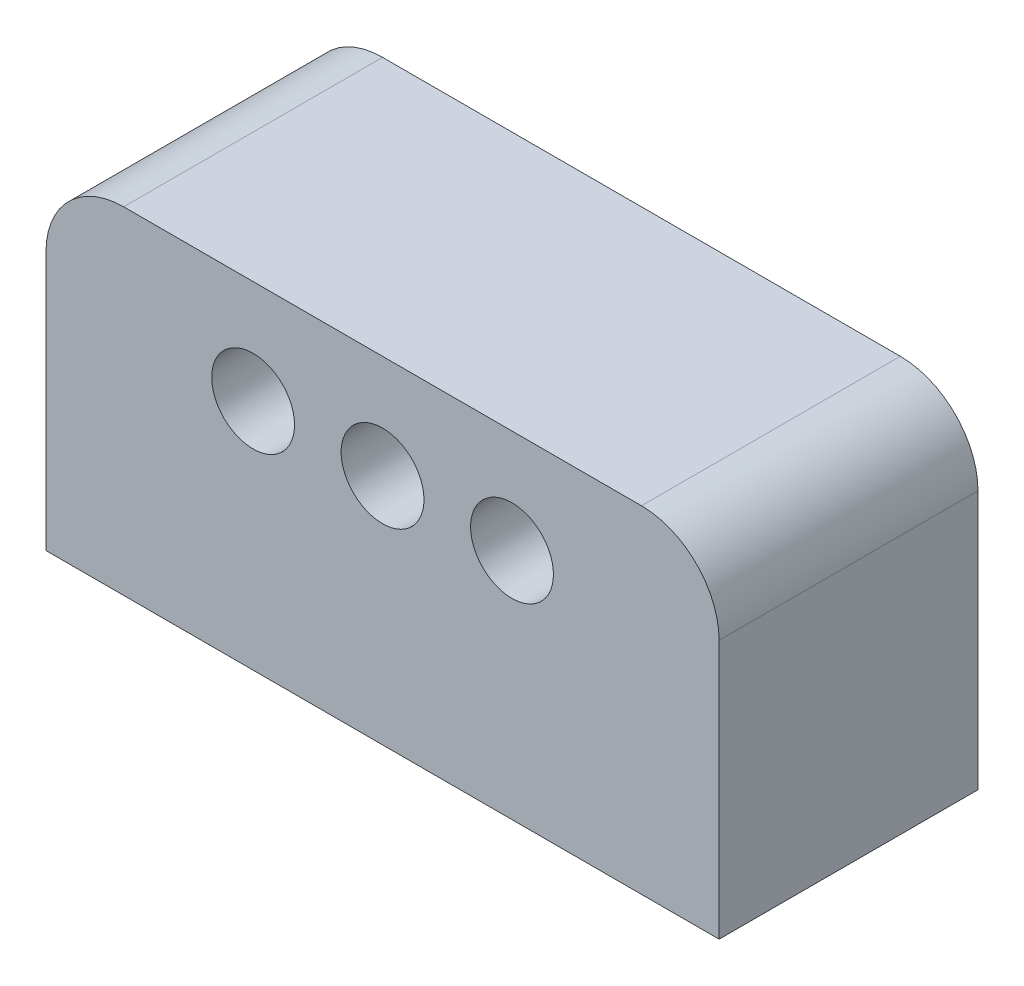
ISO-10303-21;
HEADER;
FILE_DESCRIPTION(('STEP AP214'),'2;1');
FILE_NAME('part.step','',(''),(''),'','','');
FILE_SCHEMA(('AUTOMOTIVE_DESIGN { 1 0 10303 214 1 1 1 1 }'));
ENDSEC;
DATA;
#1=APPLICATION_CONTEXT('core data for automotive mechanical design processes');
#2=APPLICATION_PROTOCOL_DEFINITION('international standard','automotive_design',2000,#1);
#3=PRODUCT_CONTEXT('',#1,'mechanical');
#4=PRODUCT('Part','Part','',(#3));
#5=PRODUCT_RELATED_PRODUCT_CATEGORY('part','',(#4));
#6=PRODUCT_DEFINITION_FORMATION('','',#4);
#7=PRODUCT_DEFINITION_CONTEXT('part definition',#1,'design');
#8=PRODUCT_DEFINITION('design','',#6,#7);
#9=PRODUCT_DEFINITION_SHAPE('','',#8);
#10=(LENGTH_UNIT() NAMED_UNIT(*) SI_UNIT(.MILLI.,.METRE.));
#11=(NAMED_UNIT(*) PLANE_ANGLE_UNIT() SI_UNIT($,.RADIAN.));
#12=(NAMED_UNIT(*) SI_UNIT($,.STERADIAN.) SOLID_ANGLE_UNIT());
#13=UNCERTAINTY_MEASURE_WITH_UNIT(LENGTH_MEASURE(1.E-05),#10,'distance_accuracy_value','');
#14=(GEOMETRIC_REPRESENTATION_CONTEXT(3) GLOBAL_UNCERTAINTY_ASSIGNED_CONTEXT((#13)) GLOBAL_UNIT_ASSIGNED_CONTEXT((#10,
#11,#12)) REPRESENTATION_CONTEXT('',''));
#15=CARTESIAN_POINT('',(0.,0.,0.));
#16=DIRECTION('',(0.,0.,1.));
#17=DIRECTION('',(1.,0.,0.));
#18=AXIS2_PLACEMENT_3D('',#15,#16,#17);
#19=CARTESIAN_POINT('',(0.,10.,-5.));
#20=DIRECTION('',(0.,-1.,0.));
#21=DIRECTION('',(0.,0.,-1.));
#22=AXIS2_PLACEMENT_3D('',#19,#20,#21);
#23=PLANE('',#22);
#24=CARTESIAN_POINT('',(-8.75,10.,0.));
#25=DIRECTION('',(0.,-1.,0.));
#26=DIRECTION('',(0.,0.,-1.));
#27=AXIS2_PLACEMENT_3D('',#24,#25,#26);
#28=CIRCLE('',#27,1.25);
#29=CARTESIAN_POINT('',(-8.75,10.,-1.25));
#30=VERTEX_POINT('',#29);
#31=EDGE_CURVE('E20',#30,#30,#28,.T.);
#32=ORIENTED_EDGE('',*,*,#31,.T.);
#33=EDGE_LOOP('',(#32));
#34=FACE_BOUND('',#33,.T.);
#35=ADVANCED_FACE('F16',(#34),#23,.T.);
#36=CARTESIAN_POINT('',(0.,10.,-5.));
#37=DIRECTION('',(0.,-1.,0.));
#38=DIRECTION('',(0.,0.,-1.));
#39=AXIS2_PLACEMENT_3D('',#36,#37,#38);
#40=PLANE('',#39);
#41=CARTESIAN_POINT('',(8.75,10.,0.));
#42=DIRECTION('',(0.,-1.,0.));
#43=DIRECTION('',(0.,0.,-1.));
#44=AXIS2_PLACEMENT_3D('',#41,#42,#43);
#45=CIRCLE('',#44,1.25);
#46=CARTESIAN_POINT('',(8.75,10.,-1.25));
#47=VERTEX_POINT('',#46);
#48=EDGE_CURVE('E117',#47,#47,#45,.T.);
#49=ORIENTED_EDGE('',*,*,#48,.T.);
#50=EDGE_LOOP('',(#49));
#51=FACE_BOUND('',#50,.T.);
#52=ADVANCED_FACE('F161',(#51),#40,.T.);
#53=CARTESIAN_POINT('',(-8.75,0.,0.));
#54=DIRECTION('',(0.,-1.,0.));
#55=DIRECTION('',(0.,0.,-1.));
#56=AXIS2_PLACEMENT_3D('',#53,#54,#55);
#57=CYLINDRICAL_SURFACE('',#56,1.25);
#58=CARTESIAN_POINT('',(-8.75,0.,0.));
#59=DIRECTION('',(0.,-1.,0.));
#60=DIRECTION('',(0.,0.,-1.));
#61=AXIS2_PLACEMENT_3D('',#58,#59,#60);
#62=CIRCLE('',#61,1.25);
#63=CARTESIAN_POINT('',(-8.75,0.,-1.25));
#64=VERTEX_POINT('',#63);
#65=EDGE_CURVE('E108',#64,#64,#62,.F.);
#66=ORIENTED_EDGE('',*,*,#65,.F.);
#67=EDGE_LOOP('',(#66));
#68=FACE_BOUND('',#67,.T.);
#69=ORIENTED_EDGE('',*,*,#31,.F.);
#70=EDGE_LOOP('',(#69));
#71=FACE_BOUND('',#70,.T.);
#72=ADVANCED_FACE('F158',(#68,#71),#57,.F.);
#73=CARTESIAN_POINT('',(8.75,0.,0.));
#74=DIRECTION('',(0.,-1.,0.));
#75=DIRECTION('',(0.,0.,-1.));
#76=AXIS2_PLACEMENT_3D('',#73,#74,#75);
#77=CYLINDRICAL_SURFACE('',#76,1.25);
#78=CARTESIAN_POINT('',(8.75,0.,0.));
#79=DIRECTION('',(0.,-1.,0.));
#80=DIRECTION('',(0.,0.,-1.));
#81=AXIS2_PLACEMENT_3D('',#78,#79,#80);
#82=CIRCLE('',#81,1.25);
#83=CARTESIAN_POINT('',(8.75,0.,-1.25));
#84=VERTEX_POINT('',#83);
#85=EDGE_CURVE('E121',#84,#84,#82,.F.);
#86=ORIENTED_EDGE('',*,*,#85,.F.);
#87=EDGE_LOOP('',(#86));
#88=FACE_BOUND('',#87,.T.);
#89=ORIENTED_EDGE('',*,*,#48,.F.);
#90=EDGE_LOOP('',(#89));
#91=FACE_BOUND('',#90,.T.);
#92=ADVANCED_FACE('F160',(#88,#91),#77,.F.);
#93=CARTESIAN_POINT('',(0.,0.,5.));
#94=DIRECTION('',(0.,0.,1.));
#95=DIRECTION('',(1.,0.,0.));
#96=AXIS2_PLACEMENT_3D('',#93,#94,#95);
#97=PLANE('',#96);
#98=CARTESIAN_POINT('',(0.,9.,5.));
#99=DIRECTION('',(0.,0.,1.));
#100=DIRECTION('',(1.,0.,0.));
#101=AXIS2_PLACEMENT_3D('',#98,#99,#100);
#102=CIRCLE('',#101,1.6);
#103=CARTESIAN_POINT('',(1.6,9.,5.));
#104=VERTEX_POINT('',#103);
#105=EDGE_CURVE('E100',#104,#104,#102,.F.);
#106=ORIENTED_EDGE('',*,*,#105,.T.);
#107=EDGE_LOOP('',(#106));
#108=FACE_BOUND('',#107,.T.);
#109=CARTESIAN_POINT('',(5.,9.,5.));
#110=DIRECTION('',(0.,0.,1.));
#111=DIRECTION('',(1.,0.,0.));
#112=AXIS2_PLACEMENT_3D('',#109,#110,#111);
#113=CIRCLE('',#112,1.6);
#114=CARTESIAN_POINT('',(6.6,9.,5.));
#115=VERTEX_POINT('',#114);
#116=EDGE_CURVE('E138',#115,#115,#113,.F.);
#117=ORIENTED_EDGE('',*,*,#116,.T.);
#118=EDGE_LOOP('',(#117));
#119=FACE_BOUND('',#118,.T.);
#120=CARTESIAN_POINT('',(-5.,9.,5.));
#121=DIRECTION('',(0.,0.,1.));
#122=DIRECTION('',(1.,0.,0.));
#123=AXIS2_PLACEMENT_3D('',#120,#121,#122);
#124=CIRCLE('',#123,1.6);
#125=CARTESIAN_POINT('',(-3.4,9.,5.));
#126=VERTEX_POINT('',#125);
#127=EDGE_CURVE('E141',#126,#126,#124,.F.);
#128=ORIENTED_EDGE('',*,*,#127,.T.);
#129=EDGE_LOOP('',(#128));
#130=FACE_BOUND('',#129,.T.);
#131=DIRECTION('',(0.,1.,0.));
#132=VECTOR('',#131,1.);
#133=CARTESIAN_POINT('',(-13.,10.,5.));
#134=LINE('',#133,#132);
#135=CARTESIAN_POINT('',(-13.,0.,5.));
#136=VERTEX_POINT('',#135);
#137=CARTESIAN_POINT('',(-13.,10.,5.));
#138=VERTEX_POINT('',#137);
#139=EDGE_CURVE('E115',#136,#138,#134,.T.);
#140=ORIENTED_EDGE('',*,*,#139,.F.);
#141=DIRECTION('',(1.,0.,0.));
#142=VECTOR('',#141,1.);
#143=CARTESIAN_POINT('',(-13.,0.,5.));
#144=LINE('',#143,#142);
#145=CARTESIAN_POINT('',(13.,0.,5.));
#146=VERTEX_POINT('',#145);
#147=EDGE_CURVE('E109',#146,#136,#144,.F.);
#148=ORIENTED_EDGE('',*,*,#147,.F.);
#149=DIRECTION('',(0.,1.,0.));
#150=VECTOR('',#149,1.);
#151=CARTESIAN_POINT('',(13.,0.,5.));
#152=LINE('',#151,#150);
#153=CARTESIAN_POINT('',(13.,10.,5.));
#154=VERTEX_POINT('',#153);
#155=EDGE_CURVE('E71',#154,#146,#152,.F.);
#156=ORIENTED_EDGE('',*,*,#155,.F.);
#157=CARTESIAN_POINT('',(10.,10.,5.));
#158=DIRECTION('',(0.,0.,1.));
#159=DIRECTION('',(1.,0.,0.));
#160=AXIS2_PLACEMENT_3D('',#157,#158,#159);
#161=CIRCLE('',#160,3.);
#162=CARTESIAN_POINT('',(10.,13.,5.));
#163=VERTEX_POINT('',#162);
#164=EDGE_CURVE('E65',#163,#154,#161,.F.);
#165=ORIENTED_EDGE('',*,*,#164,.F.);
#166=DIRECTION('',(1.,0.,0.));
#167=VECTOR('',#166,1.);
#168=CARTESIAN_POINT('',(10.,13.,5.));
#169=LINE('',#168,#167);
#170=CARTESIAN_POINT('',(-10.,13.,5.));
#171=VERTEX_POINT('',#170);
#172=EDGE_CURVE('E59',#171,#163,#169,.T.);
#173=ORIENTED_EDGE('',*,*,#172,.F.);
#174=CARTESIAN_POINT('',(-10.,10.,5.));
#175=DIRECTION('',(0.,0.,1.));
#176=DIRECTION('',(1.,0.,0.));
#177=AXIS2_PLACEMENT_3D('',#174,#175,#176);
#178=CIRCLE('',#177,3.);
#179=EDGE_CURVE('E144',#138,#171,#178,.F.);
#180=ORIENTED_EDGE('',*,*,#179,.F.);
#181=EDGE_LOOP('',(#140,#148,#156,#165,#173,#180));
#182=FACE_BOUND('',#181,.T.);
#183=ADVANCED_FACE('F169',(#108,#119,#130,#182),#97,.T.);
#184=CARTESIAN_POINT('',(-13.,10.,-5.));
#185=DIRECTION('',(-1.,0.,0.));
#186=DIRECTION('',(0.,0.,1.));
#187=AXIS2_PLACEMENT_3D('',#184,#185,#186);
#188=PLANE('',#187);
#189=ORIENTED_EDGE('',*,*,#139,.T.);
#190=DIRECTION('',(0.,0.,1.));
#191=VECTOR('',#190,1.);
#192=CARTESIAN_POINT('',(-13.,10.,-5.));
#193=LINE('',#192,#191);
#194=CARTESIAN_POINT('',(-13.,10.,-5.));
#195=VERTEX_POINT('',#194);
#196=EDGE_CURVE('E146',#195,#138,#193,.T.);
#197=ORIENTED_EDGE('',*,*,#196,.F.);
#198=DIRECTION('',(0.,1.,0.));
#199=VECTOR('',#198,1.);
#200=CARTESIAN_POINT('',(-13.,0.,-5.));
#201=LINE('',#200,#199);
#202=CARTESIAN_POINT('',(-13.,0.,-5.));
#203=VERTEX_POINT('',#202);
#204=EDGE_CURVE('E98',#195,#203,#201,.F.);
#205=ORIENTED_EDGE('',*,*,#204,.T.);
#206=DIRECTION('',(0.,0.,-1.));
#207=VECTOR('',#206,1.);
#208=CARTESIAN_POINT('',(-13.,0.,-5.));
#209=LINE('',#208,#207);
#210=EDGE_CURVE('E97',#136,#203,#209,.T.);
#211=ORIENTED_EDGE('',*,*,#210,.F.);
#212=EDGE_LOOP('',(#189,#197,#205,#211));
#213=FACE_BOUND('',#212,.T.);
#214=ADVANCED_FACE('F212',(#213),#188,.T.);
#215=CARTESIAN_POINT('',(-13.,0.,-5.));
#216=DIRECTION('',(0.,-1.,0.));
#217=DIRECTION('',(0.,0.,-1.));
#218=AXIS2_PLACEMENT_3D('',#215,#216,#217);
#219=PLANE('',#218);
#220=ORIENTED_EDGE('',*,*,#85,.T.);
#221=EDGE_LOOP('',(#220));
#222=FACE_BOUND('',#221,.T.);
#223=ORIENTED_EDGE('',*,*,#65,.T.);
#224=EDGE_LOOP('',(#223));
#225=FACE_BOUND('',#224,.T.);
#226=ORIENTED_EDGE('',*,*,#147,.T.);
#227=ORIENTED_EDGE('',*,*,#210,.T.);
#228=DIRECTION('',(1.,0.,0.));
#229=VECTOR('',#228,1.);
#230=CARTESIAN_POINT('',(0.,0.,-5.));
#231=LINE('',#230,#229);
#232=CARTESIAN_POINT('',(13.,0.,-5.));
#233=VERTEX_POINT('',#232);
#234=EDGE_CURVE('E90',#203,#233,#231,.T.);
#235=ORIENTED_EDGE('',*,*,#234,.T.);
#236=DIRECTION('',(0.,0.,-1.));
#237=VECTOR('',#236,1.);
#238=CARTESIAN_POINT('',(13.,0.,-5.));
#239=LINE('',#238,#237);
#240=EDGE_CURVE('E79',#146,#233,#239,.T.);
#241=ORIENTED_EDGE('',*,*,#240,.F.);
#242=EDGE_LOOP('',(#226,#227,#235,#241));
#243=FACE_BOUND('',#242,.T.);
#244=ADVANCED_FACE('F95',(#222,#225,#243),#219,.T.);
#245=CARTESIAN_POINT('',(13.,0.,-5.));
#246=DIRECTION('',(1.,0.,0.));
#247=DIRECTION('',(0.,0.,-1.));
#248=AXIS2_PLACEMENT_3D('',#245,#246,#247);
#249=PLANE('',#248);
#250=ORIENTED_EDGE('',*,*,#155,.T.);
#251=ORIENTED_EDGE('',*,*,#240,.T.);
#252=DIRECTION('',(0.,1.,0.));
#253=VECTOR('',#252,1.);
#254=CARTESIAN_POINT('',(13.,0.,-5.));
#255=LINE('',#254,#253);
#256=CARTESIAN_POINT('',(13.,10.,-5.));
#257=VERTEX_POINT('',#256);
#258=EDGE_CURVE('E82',#233,#257,#255,.T.);
#259=ORIENTED_EDGE('',*,*,#258,.T.);
#260=DIRECTION('',(0.,0.,1.));
#261=VECTOR('',#260,1.);
#262=CARTESIAN_POINT('',(13.,10.,-5.));
#263=LINE('',#262,#261);
#264=EDGE_CURVE('E114',#154,#257,#263,.F.);
#265=ORIENTED_EDGE('',*,*,#264,.F.);
#266=EDGE_LOOP('',(#250,#251,#259,#265));
#267=FACE_BOUND('',#266,.T.);
#268=ADVANCED_FACE('F81',(#267),#249,.T.);
#269=CARTESIAN_POINT('',(10.,10.,-5.));
#270=DIRECTION('',(0.,0.,1.));
#271=DIRECTION('',(1.,0.,0.));
#272=AXIS2_PLACEMENT_3D('',#269,#270,#271);
#273=CYLINDRICAL_SURFACE('',#272,3.);
#274=ORIENTED_EDGE('',*,*,#164,.T.);
#275=ORIENTED_EDGE('',*,*,#264,.T.);
#276=CARTESIAN_POINT('',(10.,10.,-5.));
#277=DIRECTION('',(0.,0.,1.));
#278=DIRECTION('',(1.,0.,0.));
#279=AXIS2_PLACEMENT_3D('',#276,#277,#278);
#280=CIRCLE('',#279,3.);
#281=CARTESIAN_POINT('',(10.,13.,-5.));
#282=VERTEX_POINT('',#281);
#283=EDGE_CURVE('E93',#257,#282,#280,.T.);
#284=ORIENTED_EDGE('',*,*,#283,.T.);
#285=DIRECTION('',(0.,0.,1.));
#286=VECTOR('',#285,1.);
#287=CARTESIAN_POINT('',(10.,13.,-5.));
#288=LINE('',#287,#286);
#289=EDGE_CURVE('E113',#163,#282,#288,.F.);
#290=ORIENTED_EDGE('',*,*,#289,.F.);
#291=EDGE_LOOP('',(#274,#275,#284,#290));
#292=FACE_BOUND('',#291,.T.);
#293=ADVANCED_FACE('F205',(#292),#273,.T.);
#294=CARTESIAN_POINT('',(10.,13.,-5.));
#295=DIRECTION('',(0.,1.,0.));
#296=DIRECTION('',(0.,0.,1.));
#297=AXIS2_PLACEMENT_3D('',#294,#295,#296);
#298=PLANE('',#297);
#299=ORIENTED_EDGE('',*,*,#172,.T.);
#300=ORIENTED_EDGE('',*,*,#289,.T.);
#301=DIRECTION('',(1.,0.,0.));
#302=VECTOR('',#301,1.);
#303=CARTESIAN_POINT('',(0.,13.,-5.));
#304=LINE('',#303,#302);
#305=CARTESIAN_POINT('',(-10.,13.,-5.));
#306=VERTEX_POINT('',#305);
#307=EDGE_CURVE('E134',#282,#306,#304,.F.);
#308=ORIENTED_EDGE('',*,*,#307,.T.);
#309=DIRECTION('',(0.,0.,1.));
#310=VECTOR('',#309,1.);
#311=CARTESIAN_POINT('',(-10.,13.,-5.));
#312=LINE('',#311,#310);
#313=EDGE_CURVE('E35',#171,#306,#312,.F.);
#314=ORIENTED_EDGE('',*,*,#313,.F.);
#315=EDGE_LOOP('',(#299,#300,#308,#314));
#316=FACE_BOUND('',#315,.T.);
#317=ADVANCED_FACE('F199',(#316),#298,.T.);
#318=CARTESIAN_POINT('',(-10.,10.,-5.));
#319=DIRECTION('',(0.,0.,1.));
#320=DIRECTION('',(1.,0.,0.));
#321=AXIS2_PLACEMENT_3D('',#318,#319,#320);
#322=CYLINDRICAL_SURFACE('',#321,3.);
#323=ORIENTED_EDGE('',*,*,#179,.T.);
#324=ORIENTED_EDGE('',*,*,#313,.T.);
#325=CARTESIAN_POINT('',(-10.,10.,-5.));
#326=DIRECTION('',(0.,0.,1.));
#327=DIRECTION('',(1.,0.,0.));
#328=AXIS2_PLACEMENT_3D('',#325,#326,#327);
#329=CIRCLE('',#328,3.);
#330=EDGE_CURVE('E132',#306,#195,#329,.T.);
#331=ORIENTED_EDGE('',*,*,#330,.T.);
#332=ORIENTED_EDGE('',*,*,#196,.T.);
#333=EDGE_LOOP('',(#323,#324,#331,#332));
#334=FACE_BOUND('',#333,.T.);
#335=ADVANCED_FACE('F190',(#334),#322,.T.);
#336=CARTESIAN_POINT('',(-5.,9.,-5.));
#337=DIRECTION('',(0.,0.,1.));
#338=DIRECTION('',(1.,0.,0.));
#339=AXIS2_PLACEMENT_3D('',#336,#337,#338);
#340=CYLINDRICAL_SURFACE('',#339,1.6);
#341=ORIENTED_EDGE('',*,*,#127,.F.);
#342=EDGE_LOOP('',(#341));
#343=FACE_BOUND('',#342,.T.);
#344=CARTESIAN_POINT('',(-5.,9.,-5.));
#345=DIRECTION('',(0.,0.,1.));
#346=DIRECTION('',(1.,0.,0.));
#347=AXIS2_PLACEMENT_3D('',#344,#345,#346);
#348=CIRCLE('',#347,1.6);
#349=CARTESIAN_POINT('',(-3.4,9.,-5.));
#350=VERTEX_POINT('',#349);
#351=EDGE_CURVE('E129',#350,#350,#348,.F.);
#352=ORIENTED_EDGE('',*,*,#351,.T.);
#353=EDGE_LOOP('',(#352));
#354=FACE_BOUND('',#353,.T.);
#355=ADVANCED_FACE('F188',(#343,#354),#340,.F.);
#356=CARTESIAN_POINT('',(5.,9.,-5.));
#357=DIRECTION('',(0.,0.,1.));
#358=DIRECTION('',(1.,0.,0.));
#359=AXIS2_PLACEMENT_3D('',#356,#357,#358);
#360=CYLINDRICAL_SURFACE('',#359,1.6);
#361=ORIENTED_EDGE('',*,*,#116,.F.);
#362=EDGE_LOOP('',(#361));
#363=FACE_BOUND('',#362,.T.);
#364=CARTESIAN_POINT('',(5.,9.,-5.));
#365=DIRECTION('',(0.,0.,1.));
#366=DIRECTION('',(1.,0.,0.));
#367=AXIS2_PLACEMENT_3D('',#364,#365,#366);
#368=CIRCLE('',#367,1.6);
#369=CARTESIAN_POINT('',(6.6,9.,-5.));
#370=VERTEX_POINT('',#369);
#371=EDGE_CURVE('E26',#370,#370,#368,.F.);
#372=ORIENTED_EDGE('',*,*,#371,.T.);
#373=EDGE_LOOP('',(#372));
#374=FACE_BOUND('',#373,.T.);
#375=ADVANCED_FACE('F180',(#363,#374),#360,.F.);
#376=CARTESIAN_POINT('',(0.,9.,-5.));
#377=DIRECTION('',(0.,0.,1.));
#378=DIRECTION('',(1.,0.,0.));
#379=AXIS2_PLACEMENT_3D('',#376,#377,#378);
#380=CYLINDRICAL_SURFACE('',#379,1.6);
#381=ORIENTED_EDGE('',*,*,#105,.F.);
#382=EDGE_LOOP('',(#381));
#383=FACE_BOUND('',#382,.T.);
#384=CARTESIAN_POINT('',(0.,9.,-5.));
#385=DIRECTION('',(0.,0.,1.));
#386=DIRECTION('',(1.,0.,0.));
#387=AXIS2_PLACEMENT_3D('',#384,#385,#386);
#388=CIRCLE('',#387,1.6);
#389=CARTESIAN_POINT('',(1.6,9.,-5.));
#390=VERTEX_POINT('',#389);
#391=EDGE_CURVE('E11',#390,#390,#388,.F.);
#392=ORIENTED_EDGE('',*,*,#391,.T.);
#393=EDGE_LOOP('',(#392));
#394=FACE_BOUND('',#393,.T.);
#395=ADVANCED_FACE('F175',(#383,#394),#380,.F.);
#396=CARTESIAN_POINT('',(0.,0.,-5.));
#397=DIRECTION('',(0.,0.,1.));
#398=DIRECTION('',(1.,0.,0.));
#399=AXIS2_PLACEMENT_3D('',#396,#397,#398);
#400=PLANE('',#399);
#401=ORIENTED_EDGE('',*,*,#391,.F.);
#402=EDGE_LOOP('',(#401));
#403=FACE_BOUND('',#402,.T.);
#404=ORIENTED_EDGE('',*,*,#371,.F.);
#405=EDGE_LOOP('',(#404));
#406=FACE_BOUND('',#405,.T.);
#407=ORIENTED_EDGE('',*,*,#351,.F.);
#408=EDGE_LOOP('',(#407));
#409=FACE_BOUND('',#408,.T.);
#410=ORIENTED_EDGE('',*,*,#307,.F.);
#411=ORIENTED_EDGE('',*,*,#283,.F.);
#412=ORIENTED_EDGE('',*,*,#258,.F.);
#413=ORIENTED_EDGE('',*,*,#234,.F.);
#414=ORIENTED_EDGE('',*,*,#204,.F.);
#415=ORIENTED_EDGE('',*,*,#330,.F.);
#416=EDGE_LOOP('',(#410,#411,#412,#413,#414,#415));
#417=FACE_BOUND('',#416,.T.);
#418=ADVANCED_FACE('F18',(#403,#406,#409,#417),#400,.F.);
#419=CLOSED_SHELL('',(#35,#52,#72,#92,#183,#214,#244,#268,#293,#317,#335,#355,#375,#395,#418));
#420=MANIFOLD_SOLID_BREP('B1',#419);
#421=ADVANCED_BREP_SHAPE_REPRESENTATION('',(#18,#420),#14);
#422=SHAPE_DEFINITION_REPRESENTATION(#9,#421);
ENDSEC;
END-ISO-10303-21;
